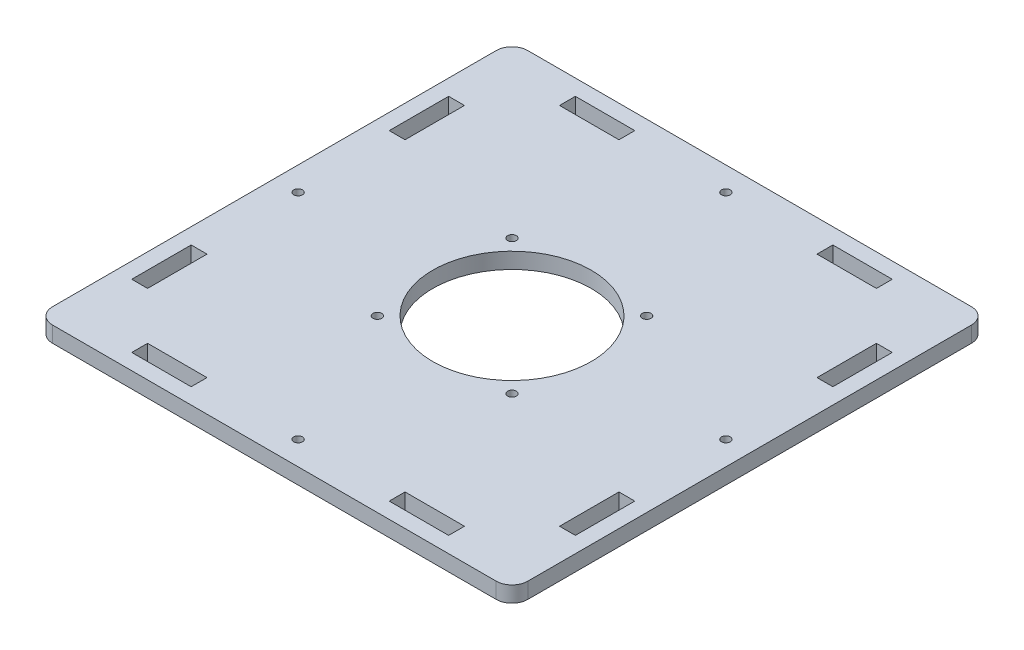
from build123d import *

# Parameters (mm, degrees)
SKIZZE1_R                       = 20
SKIZZE1_R_2                     = 1.1
SKIZZE1_W                       = 15
SKIZZE1_H                       = 4
SKIZZE1_W_2                     = 4
SKIZZE1_H_2                     = 15
AUFSATZ_LINEAR_AUSTRAGEN1_DEPTH = 4


with BuildPart() as part:
    # Skizze1 → Aufsatz-Linear austragen1 (new body)
    with BuildSketch(Plane(origin=(0, 0, 0), x_dir=(1, 0, 0), z_dir=(0, 1, 0))):
        with BuildLine():
            Line((-56, 60), (56, 60))
            ThreePointArc((56, 60), (58.828427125, 58.828427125), (60, 56))
            Line((60, 56), (60, -56))
            ThreePointArc((60, -56), (58.828427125, -58.828427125), (56, -60))
            Line((56, -60), (-56, -60))
            ThreePointArc((-56, -60), (-58.828427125, -58.828427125), (-60, -56))
            Line((-60, -56), (-60, 56))
            ThreePointArc((-60, 56), (-58.828427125, 58.828427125), (-56, 60))
        make_face()
        with Locations(Location((0, 0, 0), (0, 0, 270))):
            Circle(SKIZZE1_R, mode=Mode.SUBTRACT)
        with Locations(Location((-17, 17, 0), (0, 0, 270))):
            Circle(SKIZZE1_R_2, mode=Mode.SUBTRACT)
        with Locations(Location((17, 17, 0), (0, 0, 90))):
            Circle(SKIZZE1_R_2, mode=Mode.SUBTRACT)
        with Locations(Location((17, -17, 0), (0, 0, 270))):
            Circle(SKIZZE1_R_2, mode=Mode.SUBTRACT)
        with Locations(Location((-17, -17, 0), (0, 0, 90))):
            Circle(SKIZZE1_R_2, mode=Mode.SUBTRACT)
        with Locations(Location((0, 54, 0), (0, 0, 270))):
            Circle(SKIZZE1_R_2, mode=Mode.SUBTRACT)
        with Locations(Location((54, 0, 0), (0, 0, 270))):
            Circle(SKIZZE1_R_2, mode=Mode.SUBTRACT)
        with Locations(Location((0, -54, 0), (0, 0, 270))):
            Circle(SKIZZE1_R_2, mode=Mode.SUBTRACT)
        with Locations(Location((-54, 0, 0), (0, 0, 270))):
            Circle(SKIZZE1_R_2, mode=Mode.SUBTRACT)
        with Locations((32.5, 54)):
            Rectangle(SKIZZE1_W, SKIZZE1_H, mode=Mode.SUBTRACT)
        with Locations((-32.5, 54)):
            Rectangle(SKIZZE1_W, SKIZZE1_H, mode=Mode.SUBTRACT)
        with Locations((54, -32.5)):
            Rectangle(SKIZZE1_W_2, SKIZZE1_H_2, mode=Mode.SUBTRACT)
        with Locations((54, 32.5)):
            Rectangle(SKIZZE1_W_2, SKIZZE1_H_2, mode=Mode.SUBTRACT)
        with Locations((-32.5, -54)):
            Rectangle(SKIZZE1_W, SKIZZE1_H, mode=Mode.SUBTRACT)
        with Locations((32.5, -54)):
            Rectangle(SKIZZE1_W, SKIZZE1_H, mode=Mode.SUBTRACT)
        with Locations((-54, 32.5)):
            Rectangle(SKIZZE1_W_2, SKIZZE1_H_2, mode=Mode.SUBTRACT)
        with Locations((-54, -32.5)):
            Rectangle(SKIZZE1_W_2, SKIZZE1_H_2, mode=Mode.SUBTRACT)
    extrude(amount=AUFSATZ_LINEAR_AUSTRAGEN1_DEPTH)


solid = part.part
